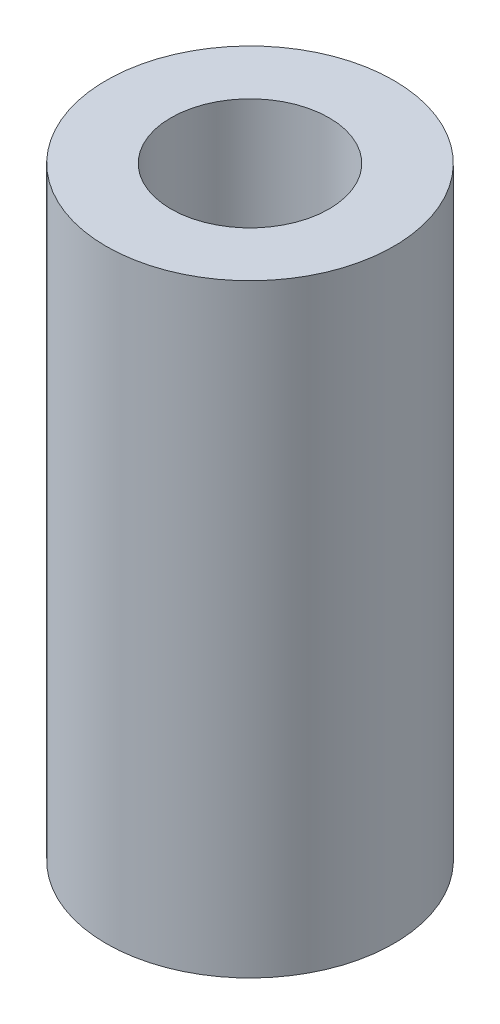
ISO-10303-21;
HEADER;
FILE_DESCRIPTION(('STEP AP214'),'2;1');
FILE_NAME('part.step','',(''),(''),'','','');
FILE_SCHEMA(('AUTOMOTIVE_DESIGN { 1 0 10303 214 1 1 1 1 }'));
ENDSEC;
DATA;
#1=APPLICATION_CONTEXT('core data for automotive mechanical design processes');
#2=APPLICATION_PROTOCOL_DEFINITION('international standard','automotive_design',2000,#1);
#3=PRODUCT_CONTEXT('',#1,'mechanical');
#4=PRODUCT('Part','Part','',(#3));
#5=PRODUCT_RELATED_PRODUCT_CATEGORY('part','',(#4));
#6=PRODUCT_DEFINITION_FORMATION('','',#4);
#7=PRODUCT_DEFINITION_CONTEXT('part definition',#1,'design');
#8=PRODUCT_DEFINITION('design','',#6,#7);
#9=PRODUCT_DEFINITION_SHAPE('','',#8);
#10=(LENGTH_UNIT() NAMED_UNIT(*) SI_UNIT(.MILLI.,.METRE.));
#11=(NAMED_UNIT(*) PLANE_ANGLE_UNIT() SI_UNIT($,.RADIAN.));
#12=(NAMED_UNIT(*) SI_UNIT($,.STERADIAN.) SOLID_ANGLE_UNIT());
#13=UNCERTAINTY_MEASURE_WITH_UNIT(LENGTH_MEASURE(1.E-05),#10,'distance_accuracy_value','');
#14=(GEOMETRIC_REPRESENTATION_CONTEXT(3) GLOBAL_UNCERTAINTY_ASSIGNED_CONTEXT((#13)) GLOBAL_UNIT_ASSIGNED_CONTEXT((#10,
#11,#12)) REPRESENTATION_CONTEXT('',''));
#15=CARTESIAN_POINT('',(0.,0.,0.));
#16=DIRECTION('',(0.,0.,1.));
#17=DIRECTION('',(1.,0.,0.));
#18=AXIS2_PLACEMENT_3D('',#15,#16,#17);
#19=CARTESIAN_POINT('',(0.,21.,0.));
#20=DIRECTION('',(0.,1.,0.));
#21=DIRECTION('',(0.,0.,1.));
#22=AXIS2_PLACEMENT_3D('',#19,#20,#21);
#23=PLANE('',#22);
#24=CARTESIAN_POINT('',(0.,21.,0.));
#25=DIRECTION('',(0.,1.,0.));
#26=DIRECTION('',(0.,0.,1.));
#27=AXIS2_PLACEMENT_3D('',#24,#25,#26);
#28=CIRCLE('',#27,5.);
#29=CARTESIAN_POINT('',(0.,21.,-5.));
#30=VERTEX_POINT('',#29);
#31=EDGE_CURVE('E10',#30,#30,#28,.T.);
#32=ORIENTED_EDGE('',*,*,#31,.T.);
#33=EDGE_LOOP('',(#32));
#34=FACE_BOUND('',#33,.T.);
#35=CARTESIAN_POINT('',(0.,21.,0.));
#36=DIRECTION('',(0.,1.,0.));
#37=DIRECTION('',(0.,0.,1.));
#38=AXIS2_PLACEMENT_3D('',#35,#36,#37);
#39=CIRCLE('',#38,2.75);
#40=CARTESIAN_POINT('',(0.,21.,-2.75));
#41=VERTEX_POINT('',#40);
#42=EDGE_CURVE('E39',#41,#41,#39,.T.);
#43=ORIENTED_EDGE('',*,*,#42,.F.);
#44=EDGE_LOOP('',(#43));
#45=FACE_BOUND('',#44,.T.);
#46=ADVANCED_FACE('F28',(#34,#45),#23,.T.);
#47=CARTESIAN_POINT('',(0.,0.,0.));
#48=DIRECTION('',(0.,1.,0.));
#49=DIRECTION('',(0.,0.,1.));
#50=AXIS2_PLACEMENT_3D('',#47,#48,#49);
#51=PLANE('',#50);
#52=CARTESIAN_POINT('',(0.,0.,0.));
#53=DIRECTION('',(0.,1.,0.));
#54=DIRECTION('',(0.,0.,1.));
#55=AXIS2_PLACEMENT_3D('',#52,#53,#54);
#56=CIRCLE('',#55,5.);
#57=CARTESIAN_POINT('',(0.,0.,-5.));
#58=VERTEX_POINT('',#57);
#59=EDGE_CURVE('E35',#58,#58,#56,.T.);
#60=ORIENTED_EDGE('',*,*,#59,.F.);
#61=EDGE_LOOP('',(#60));
#62=FACE_BOUND('',#61,.T.);
#63=CARTESIAN_POINT('',(0.,0.,0.));
#64=DIRECTION('',(0.,1.,0.));
#65=DIRECTION('',(0.,0.,1.));
#66=AXIS2_PLACEMENT_3D('',#63,#64,#65);
#67=CIRCLE('',#66,2.75);
#68=CARTESIAN_POINT('',(0.,0.,-2.75));
#69=VERTEX_POINT('',#68);
#70=EDGE_CURVE('E43',#69,#69,#67,.T.);
#71=ORIENTED_EDGE('',*,*,#70,.T.);
#72=EDGE_LOOP('',(#71));
#73=FACE_BOUND('',#72,.T.);
#74=ADVANCED_FACE('F49',(#62,#73),#51,.F.);
#75=CARTESIAN_POINT('',(0.,21.,0.));
#76=DIRECTION('',(0.,-1.,0.));
#77=DIRECTION('',(0.,0.,-1.));
#78=AXIS2_PLACEMENT_3D('',#75,#76,#77);
#79=CYLINDRICAL_SURFACE('',#78,5.);
#80=CARTESIAN_POINT('',(0.,21.,-5.));
#81=CARTESIAN_POINT('',(0.,20.78125,-5.));
#82=CARTESIAN_POINT('',(0.,20.5625,-5.));
#83=CARTESIAN_POINT('',(0.,20.125,-5.));
#84=CARTESIAN_POINT('',(0.,19.90625,-5.));
#85=CARTESIAN_POINT('',(0.,19.46875,-5.));
#86=CARTESIAN_POINT('',(0.,19.25,-5.));
#87=CARTESIAN_POINT('',(0.,18.8125,-5.));
#88=CARTESIAN_POINT('',(0.,18.59375,-5.));
#89=CARTESIAN_POINT('',(0.,18.15625,-5.));
#90=CARTESIAN_POINT('',(0.,17.9375,-5.));
#91=CARTESIAN_POINT('',(0.,17.5,-5.));
#92=CARTESIAN_POINT('',(0.,17.28125,-5.));
#93=CARTESIAN_POINT('',(0.,16.84375,-5.));
#94=CARTESIAN_POINT('',(0.,16.625,-5.));
#95=CARTESIAN_POINT('',(0.,16.1875,-5.));
#96=CARTESIAN_POINT('',(0.,15.96875,-5.));
#97=CARTESIAN_POINT('',(0.,15.53125,-5.));
#98=CARTESIAN_POINT('',(0.,15.3125,-5.));
#99=CARTESIAN_POINT('',(0.,14.875,-5.));
#100=CARTESIAN_POINT('',(0.,14.65625,-5.));
#101=CARTESIAN_POINT('',(0.,14.21875,-5.));
#102=CARTESIAN_POINT('',(0.,14.,-5.));
#103=CARTESIAN_POINT('',(0.,13.5625,-5.));
#104=CARTESIAN_POINT('',(0.,13.34375,-5.));
#105=CARTESIAN_POINT('',(0.,12.90625,-5.));
#106=CARTESIAN_POINT('',(0.,12.6875,-5.));
#107=CARTESIAN_POINT('',(0.,12.25,-5.));
#108=CARTESIAN_POINT('',(0.,12.03125,-5.));
#109=CARTESIAN_POINT('',(0.,11.59375,-5.));
#110=CARTESIAN_POINT('',(0.,11.375,-5.));
#111=CARTESIAN_POINT('',(0.,10.9375,-5.));
#112=CARTESIAN_POINT('',(0.,10.71875,-5.));
#113=CARTESIAN_POINT('',(0.,10.28125,-5.));
#114=CARTESIAN_POINT('',(0.,10.0625,-5.));
#115=CARTESIAN_POINT('',(0.,9.625,-5.));
#116=CARTESIAN_POINT('',(0.,9.40625,-5.));
#117=CARTESIAN_POINT('',(0.,8.96875,-5.));
#118=CARTESIAN_POINT('',(0.,8.75,-5.));
#119=CARTESIAN_POINT('',(0.,8.3125,-5.));
#120=CARTESIAN_POINT('',(0.,8.09375,-5.));
#121=CARTESIAN_POINT('',(0.,7.65625,-5.));
#122=CARTESIAN_POINT('',(0.,7.4375,-5.));
#123=CARTESIAN_POINT('',(0.,7.,-5.));
#124=CARTESIAN_POINT('',(0.,6.78125,-5.));
#125=CARTESIAN_POINT('',(0.,6.34375,-5.));
#126=CARTESIAN_POINT('',(0.,6.125,-5.));
#127=CARTESIAN_POINT('',(0.,5.6875,-5.));
#128=CARTESIAN_POINT('',(0.,5.46875,-5.));
#129=CARTESIAN_POINT('',(0.,5.03125,-5.));
#130=CARTESIAN_POINT('',(0.,4.8125,-5.));
#131=CARTESIAN_POINT('',(0.,4.375,-5.));
#132=CARTESIAN_POINT('',(0.,4.15625,-5.));
#133=CARTESIAN_POINT('',(0.,3.71875,-5.));
#134=CARTESIAN_POINT('',(0.,3.5,-5.));
#135=CARTESIAN_POINT('',(0.,3.0625,-5.));
#136=CARTESIAN_POINT('',(0.,2.84375,-5.));
#137=CARTESIAN_POINT('',(0.,2.40625,-5.));
#138=CARTESIAN_POINT('',(0.,2.1875,-5.));
#139=CARTESIAN_POINT('',(0.,1.75,-5.));
#140=CARTESIAN_POINT('',(0.,1.53125,-5.));
#141=CARTESIAN_POINT('',(0.,1.09375,-5.));
#142=CARTESIAN_POINT('',(0.,0.875000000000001,-5.));
#143=CARTESIAN_POINT('',(0.,0.4375,-5.));
#144=CARTESIAN_POINT('',(0.,0.21875,-5.));
#145=CARTESIAN_POINT('',(0.,0.,-5.));
#146=B_SPLINE_CURVE_WITH_KNOTS('',3,(#80,#81,#82,#83,#84,#85,#86,#87,#88,#89,#90,#91,#92,#93,
#94,#95,#96,#97,#98,#99,#100,#101,#102,#103,#104,#105,#106,#107,#108,#109,#110,#111,#112,#113,
#114,#115,#116,#117,#118,#119,#120,#121,#122,#123,#124,#125,#126,#127,#128,#129,#130,#131,#132,
#133,#134,#135,#136,#137,#138,#139,#140,#141,#142,#143,#144,#145),.UNSPECIFIED.,.F.,.F.,(4,2,2,
2,2,2,2,2,2,2,2,2,2,2,2,2,2,2,2,2,2,2,2,2,2,2,2,2,2,2,2,2,4),(0.,0.656250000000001,1.3125,
1.96875,2.625,3.28125,3.9375,4.59375,5.25,5.90625,6.5625,7.21875,7.875,8.53125,9.1875,9.84375,
10.5,11.15625,11.8125,12.46875,13.125,13.78125,14.4375,15.09375,15.75,16.40625,17.0625,17.71875,
18.375,19.03125,19.6875,20.34375,21.),.UNSPECIFIED.);
#147=EDGE_CURVE('BSEAM30',#30,#58,#146,.T.);
#148=ORIENTED_EDGE('',*,*,#31,.F.);
#149=ORIENTED_EDGE('',*,*,#59,.T.);
#150=ORIENTED_EDGE('',*,*,#147,.T.);
#151=ORIENTED_EDGE('',*,*,#147,.F.);
#152=EDGE_LOOP('',(#148,#150,#149,#151));
#153=FACE_BOUND('',#152,.T.);
#154=ADVANCED_FACE('F30',(#153),#79,.T.);
#155=CARTESIAN_POINT('',(0.,21.,0.));
#156=DIRECTION('',(0.,-1.,0.));
#157=DIRECTION('',(0.,0.,-1.));
#158=AXIS2_PLACEMENT_3D('',#155,#156,#157);
#159=CYLINDRICAL_SURFACE('',#158,2.75);
#160=CARTESIAN_POINT('',(0.,21.,-2.75));
#161=CARTESIAN_POINT('',(0.,20.78125,-2.75));
#162=CARTESIAN_POINT('',(0.,20.5625,-2.75));
#163=CARTESIAN_POINT('',(0.,20.125,-2.75));
#164=CARTESIAN_POINT('',(0.,19.90625,-2.75));
#165=CARTESIAN_POINT('',(0.,19.46875,-2.75));
#166=CARTESIAN_POINT('',(0.,19.25,-2.75));
#167=CARTESIAN_POINT('',(0.,18.8125,-2.75));
#168=CARTESIAN_POINT('',(0.,18.59375,-2.75));
#169=CARTESIAN_POINT('',(0.,18.15625,-2.75));
#170=CARTESIAN_POINT('',(0.,17.9375,-2.75));
#171=CARTESIAN_POINT('',(0.,17.5,-2.75));
#172=CARTESIAN_POINT('',(0.,17.28125,-2.75));
#173=CARTESIAN_POINT('',(0.,16.84375,-2.75));
#174=CARTESIAN_POINT('',(0.,16.625,-2.75));
#175=CARTESIAN_POINT('',(0.,16.1875,-2.75));
#176=CARTESIAN_POINT('',(0.,15.96875,-2.75));
#177=CARTESIAN_POINT('',(0.,15.53125,-2.75));
#178=CARTESIAN_POINT('',(0.,15.3125,-2.75));
#179=CARTESIAN_POINT('',(0.,14.875,-2.75));
#180=CARTESIAN_POINT('',(0.,14.65625,-2.75));
#181=CARTESIAN_POINT('',(0.,14.21875,-2.75));
#182=CARTESIAN_POINT('',(0.,14.,-2.75));
#183=CARTESIAN_POINT('',(0.,13.5625,-2.75));
#184=CARTESIAN_POINT('',(0.,13.34375,-2.75));
#185=CARTESIAN_POINT('',(0.,12.90625,-2.75));
#186=CARTESIAN_POINT('',(0.,12.6875,-2.75));
#187=CARTESIAN_POINT('',(0.,12.25,-2.75));
#188=CARTESIAN_POINT('',(0.,12.03125,-2.75));
#189=CARTESIAN_POINT('',(0.,11.59375,-2.75));
#190=CARTESIAN_POINT('',(0.,11.375,-2.75));
#191=CARTESIAN_POINT('',(0.,10.9375,-2.75));
#192=CARTESIAN_POINT('',(0.,10.71875,-2.75));
#193=CARTESIAN_POINT('',(0.,10.28125,-2.75));
#194=CARTESIAN_POINT('',(0.,10.0625,-2.75));
#195=CARTESIAN_POINT('',(0.,9.625,-2.75));
#196=CARTESIAN_POINT('',(0.,9.40625,-2.75));
#197=CARTESIAN_POINT('',(0.,8.96875,-2.75));
#198=CARTESIAN_POINT('',(0.,8.75,-2.75));
#199=CARTESIAN_POINT('',(0.,8.3125,-2.75));
#200=CARTESIAN_POINT('',(0.,8.09375,-2.75));
#201=CARTESIAN_POINT('',(0.,7.65625,-2.75));
#202=CARTESIAN_POINT('',(0.,7.4375,-2.75));
#203=CARTESIAN_POINT('',(0.,7.,-2.75));
#204=CARTESIAN_POINT('',(0.,6.78125,-2.75));
#205=CARTESIAN_POINT('',(0.,6.34375,-2.75));
#206=CARTESIAN_POINT('',(0.,6.125,-2.75));
#207=CARTESIAN_POINT('',(0.,5.6875,-2.75));
#208=CARTESIAN_POINT('',(0.,5.46875,-2.75));
#209=CARTESIAN_POINT('',(0.,5.03125,-2.75));
#210=CARTESIAN_POINT('',(0.,4.8125,-2.75));
#211=CARTESIAN_POINT('',(0.,4.375,-2.75));
#212=CARTESIAN_POINT('',(0.,4.15625,-2.75));
#213=CARTESIAN_POINT('',(0.,3.71875,-2.75));
#214=CARTESIAN_POINT('',(0.,3.5,-2.75));
#215=CARTESIAN_POINT('',(0.,3.0625,-2.75));
#216=CARTESIAN_POINT('',(0.,2.84375,-2.75));
#217=CARTESIAN_POINT('',(0.,2.40625,-2.75));
#218=CARTESIAN_POINT('',(0.,2.1875,-2.75));
#219=CARTESIAN_POINT('',(0.,1.75,-2.75));
#220=CARTESIAN_POINT('',(0.,1.53125,-2.75));
#221=CARTESIAN_POINT('',(0.,1.09375,-2.75));
#222=CARTESIAN_POINT('',(0.,0.875000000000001,-2.75));
#223=CARTESIAN_POINT('',(0.,0.4375,-2.75));
#224=CARTESIAN_POINT('',(0.,0.21875,-2.75));
#225=CARTESIAN_POINT('',(0.,0.,-2.75));
#226=B_SPLINE_CURVE_WITH_KNOTS('',3,(#160,#161,#162,#163,#164,#165,#166,#167,#168,#169,#170,
#171,#172,#173,#174,#175,#176,#177,#178,#179,#180,#181,#182,#183,#184,#185,#186,#187,#188,#189,
#190,#191,#192,#193,#194,#195,#196,#197,#198,#199,#200,#201,#202,#203,#204,#205,#206,#207,#208,
#209,#210,#211,#212,#213,#214,#215,#216,#217,#218,#219,#220,#221,#222,#223,#224,#225),
.UNSPECIFIED.,.F.,.F.,(4,2,2,2,2,2,2,2,2,2,2,2,2,2,2,2,2,2,2,2,2,2,2,2,2,2,2,2,2,2,2,2,4),(0.,
0.656250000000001,1.3125,1.96875,2.625,3.28125,3.9375,4.59375,5.25,5.90625,6.5625,7.21875,7.875,
8.53125,9.1875,9.84375,10.5,11.15625,11.8125,12.46875,13.125,13.78125,14.4375,15.09375,15.75,
16.40625,17.0625,17.71875,18.375,19.03125,19.6875,20.34375,21.),.UNSPECIFIED.);
#227=EDGE_CURVE('BSEAM51',#41,#69,#226,.T.);
#228=ORIENTED_EDGE('',*,*,#42,.T.);
#229=ORIENTED_EDGE('',*,*,#70,.F.);
#230=ORIENTED_EDGE('',*,*,#227,.T.);
#231=ORIENTED_EDGE('',*,*,#227,.F.);
#232=EDGE_LOOP('',(#228,#230,#229,#231));
#233=FACE_BOUND('',#232,.T.);
#234=ADVANCED_FACE('F51',(#233),#159,.F.);
#235=CLOSED_SHELL('',(#46,#74,#154,#234));
#236=MANIFOLD_SOLID_BREP('B2',#235);
#237=ADVANCED_BREP_SHAPE_REPRESENTATION('',(#18,#236),#14);
#238=SHAPE_DEFINITION_REPRESENTATION(#9,#237);
ENDSEC;
END-ISO-10303-21;
